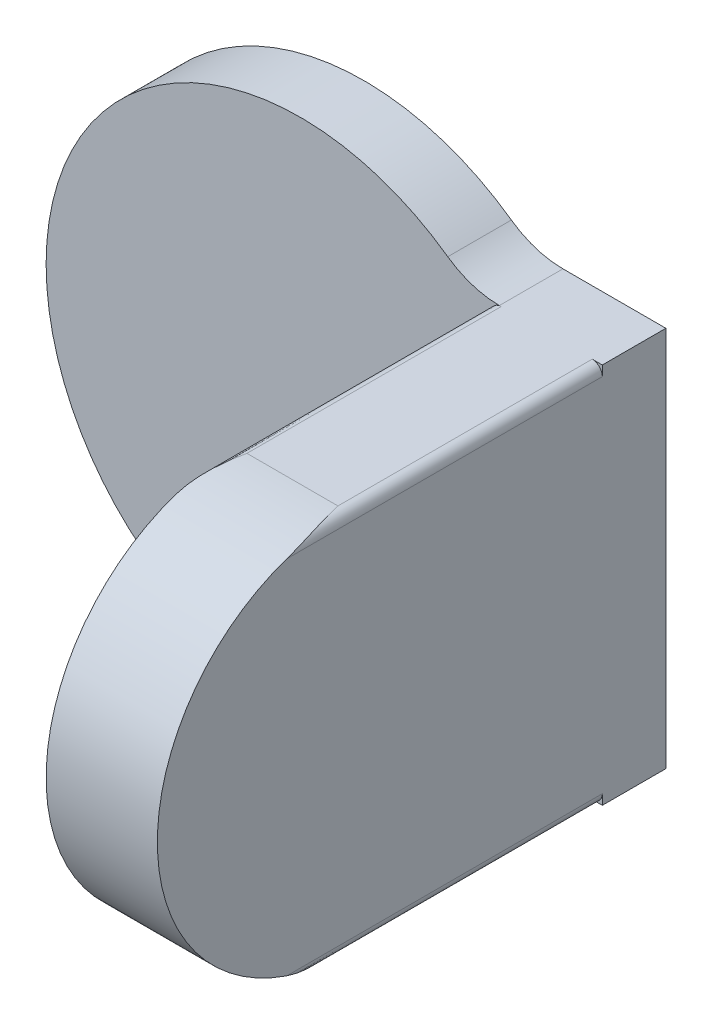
from build123d import *

# Parameters (mm, degrees)
EXTRUDE1_DEPTH     = 10
EXTRUDE2_DEPTH     = 17.5
CUT_EXTRUDE1_DEPTH = 94.574836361


with BuildPart() as part:
    # Sketch1 → Extrude1 (new body)
    with BuildSketch(Plane.XY):
        with BuildLine():
            Line((31.304951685, 30), (47.5, 30))
            Line((47.5, 30), (47.5, -30))
            Line((47.5, -30), (31.304951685, -30))
            ThreePointArc((31.304951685, -30), (27.044887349, -30.663889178), (23.1888531, -32.592592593))
            ThreePointArc((23.1888531, -32.592592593), (-40, 0), (23.1888531, 32.592592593))
            ThreePointArc((23.1888531, 32.592592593), (27.044887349, 30.663889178), (31.304951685, 30))
        make_face()
    extrude(amount=EXTRUDE1_DEPTH)

    # Sketch3 → Extrude2 (add)
    with BuildSketch(Plane(origin=(47.5, 0, 0), x_dir=(0, 0, -1), z_dir=(1, 0, 0))):
        with BuildLine():
            Line((0, 30), (-50, 30))
            ThreePointArc((-50, 30), (-80, 0), (-50, -30))
            Line((-50, -30), (0, -30))
            Line((0, -30), (0, 30))
        make_face()
    extrude(amount=-EXTRUDE2_DEPTH)

    # Sketch4 → Cut-Extrude1 (cut, through all)
    with BuildSketch(Plane.XY.offset(10)):
        with BuildLine():
            Line((45.91, 30), (47.5, 30))
            Line((47.5, 30), (47.5, 28.41))
            ThreePointArc((47.5, 28.41), (47.034299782, 29.534299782), (45.91, 30))
        make_face()
        with BuildLine():
            Line((30, 30), (30, 28.41))
            ThreePointArc((30, 28.41), (30.465700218, 29.534299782), (31.59, 30))
            Line((31.59, 30), (30, 30))
        make_face()
        with BuildLine():
            Line((31.59, -30), (30, -30))
            Line((30, -30), (30, -28.41))
            ThreePointArc((30, -28.41), (30.465700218, -29.534299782), (31.59, -30))
        make_face()
        with BuildLine():
            Line((47.5, -30), (47.5, -28.41))
            ThreePointArc((47.5, -28.41), (47.034299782, -29.534299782), (45.91, -30))
            Line((45.91, -30), (47.5, -30))
        make_face()
    extrude(amount=CUT_EXTRUDE1_DEPTH, mode=Mode.SUBTRACT)


solid = part.part
